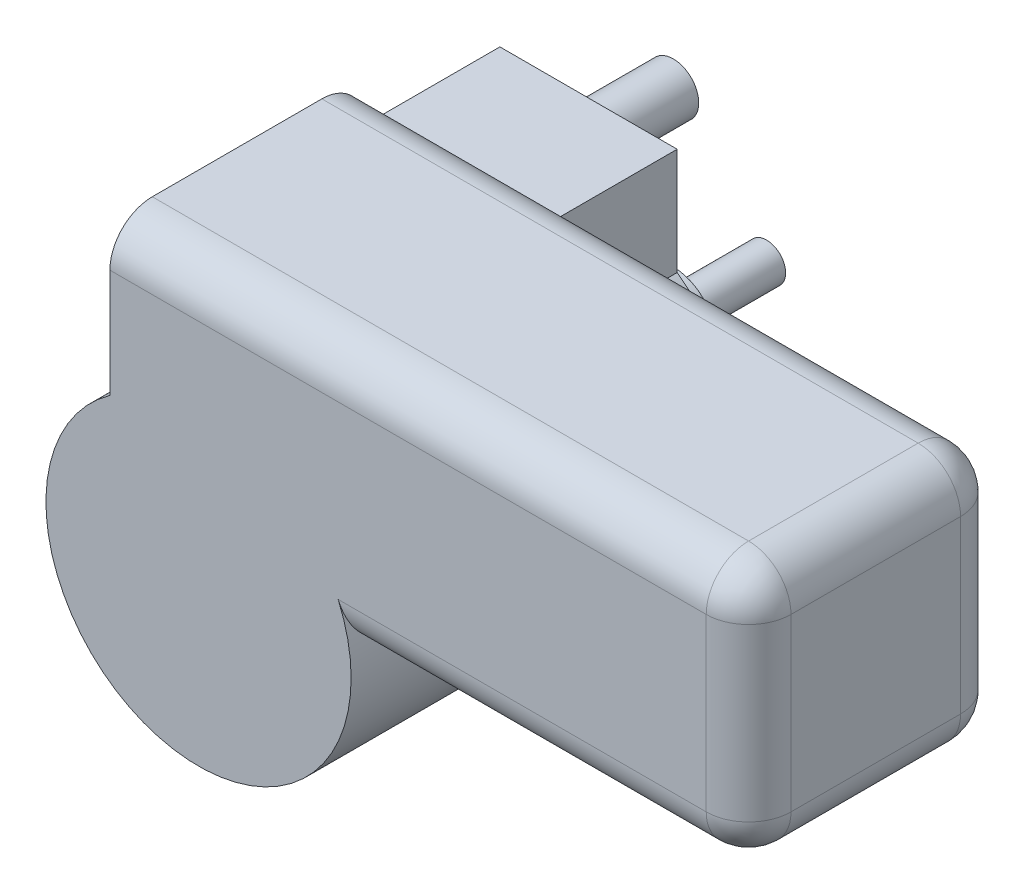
from build123d import *

# Parameters (mm, degrees)
SKETCH1_R                        = 36
BOSS_EXTRUDE1_DEPTH              = 92
BOSS_EXTRUDE2_DEPTH              = 60
SKETCH5_W                        = 41.821642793
SKETCH5_H                        = 25.195903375
BOSS_EXTRUDE3_DEPTH              = 32
SKETCH4_R                        = 10
SKETCH4_R_2                      = 6
BOSS_EXTRUDE4_DEPTH              = 20
SKETCH6_R                        = 4.5
BOSS_EXTRUDE5_DEPTH              = 22
M6X0_75_TAPPED_HOLE1_D           = 5.25
M6X0_75_TAPPED_HOLE1_DEPTH       = 14.25
M6X0_75_TAPPED_HOLE1_CSINK_D     = 6.05
M6X0_75_TAPPED_HOLE1_CSINK_ANGLE = 90
M6X0_75_TAPPED_HOLE1_TIP         = 1.577259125
FILLET2_R                        = 10
FILLET3_R                        = 10


with BuildPart() as part:
    # Sketch1 → Boss-Extrude1 (new body)
    with BuildSketch(Plane.XY):
        Circle(SKETCH1_R)
    extrude(amount=BOSS_EXTRUDE1_DEPTH)



with BuildPart() as body_2:
    # Sketch2 → Boss-Extrude2 (new body)
    with BuildSketch(Plane.XY.offset(92)):
        with BuildLine():
            Line((-20.910642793, 64.881420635), (-20.910642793, 29.30435152))
            ThreePointArc((-20.910642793, 29.30435152), (14.42530717, 32.983488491), (35.71255056, 4.540234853))
            Line((35.71255056, 4.540234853), (129.762841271, 4.540234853))
            Line((129.762841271, 4.540234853), (129.762841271, 29.30435152))
            Line((129.762841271, 29.30435152), (129.762841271, 64.881420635))
            Line((129.762841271, 64.881420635), (-20.910642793, 64.881420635))
        make_face()
    extrude(amount=-BOSS_EXTRUDE2_DEPTH)


with BuildPart() as part_1:
    add(part.part)

    add(body_2.part)  # Boss-Extrude3 merges body 2
    # Sketch5 → Boss-Extrude3 (add)
    with BuildSketch(Plane(origin=(0, 0, 0), x_dir=(-1, 0, 0), z_dir=(0, 0, -1))):
        with Locations((-0.000178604, 41.902048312)):
            Rectangle(SKETCH5_W, SKETCH5_H)
    extrude(amount=-BOSS_EXTRUDE3_DEPTH)

    # Sketch4 → Boss-Extrude4 (add)
    with BuildSketch(Plane(origin=(0, 0, 0), x_dir=(-1, 0, 0), z_dir=(0, 0, -1))):
        Circle(SKETCH4_R)
        with Locations(Location((33.5, -19.5, 0), (0, 0, 208.374405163))):
            Circle(SKETCH4_R_2)
        with Locations(Location((-33.5, -19.5, 0), (0, 0, 88.780880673))):
            Circle(SKETCH4_R_2)
        with Locations(Location((0, 46.5, 0), (0, 0, 180))):
            Circle(SKETCH4_R_2)
    extrude(amount=BOSS_EXTRUDE4_DEPTH)

    # Sketch6 → Boss-Extrude5 (add)
    with BuildSketch(Plane(origin=(0, 0, -20), x_dir=(-1, 0, 0), z_dir=(0, 0, -1))):
        Circle(SKETCH6_R)
    extrude(amount=BOSS_EXTRUDE5_DEPTH)

    # M6x0.75 Tapped Hole1
    with Locations(Plane(origin=(0, 0, -20), x_dir=(-1, 0, 0), z_dir=(0, 0, -1))):
        with Locations((-33.5, -19.5), (33.5, -19.5), (0, 46.5)):
            CounterSinkHole(M6X0_75_TAPPED_HOLE1_D / 2, M6X0_75_TAPPED_HOLE1_CSINK_D / 2, depth=M6X0_75_TAPPED_HOLE1_DEPTH, counter_sink_angle=M6X0_75_TAPPED_HOLE1_CSINK_ANGLE)
            with Locations((0, 0, -(M6X0_75_TAPPED_HOLE1_DEPTH + M6X0_75_TAPPED_HOLE1_TIP / 2))):  # 118° drill point
                Cone(0, M6X0_75_TAPPED_HOLE1_D / 2, M6X0_75_TAPPED_HOLE1_TIP, mode=Mode.SUBTRACT)

    # Fillet2
    fillet2_edges = [part_1.edges().sort_by_distance(p)[0] for p in [
        (54.426099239, 64.881420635, 92),
        (54.426099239, 64.881420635, 32),
    ]]
    fillet(fillet2_edges, radius=FILLET2_R)

    # Fillet3
    fillet3_edges = [part_1.edges().sort_by_distance(p)[0] for p in [
        (82.737695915, 4.540234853, 92),
        (129.762841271, 4.540234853, 62),
        (82.737695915, 4.540234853, 32),
        (129.762841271, 29.710827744, 32),
        (129.762841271, 29.710827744, 92),
        (129.762841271, 64.881420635, 62),
        (129.762841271, 61.952488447, 89.071067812),
        (129.762841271, 61.952488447, 34.928932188),
    ]]
    fillet(fillet3_edges, radius=FILLET3_R)


solid = part_1.part
